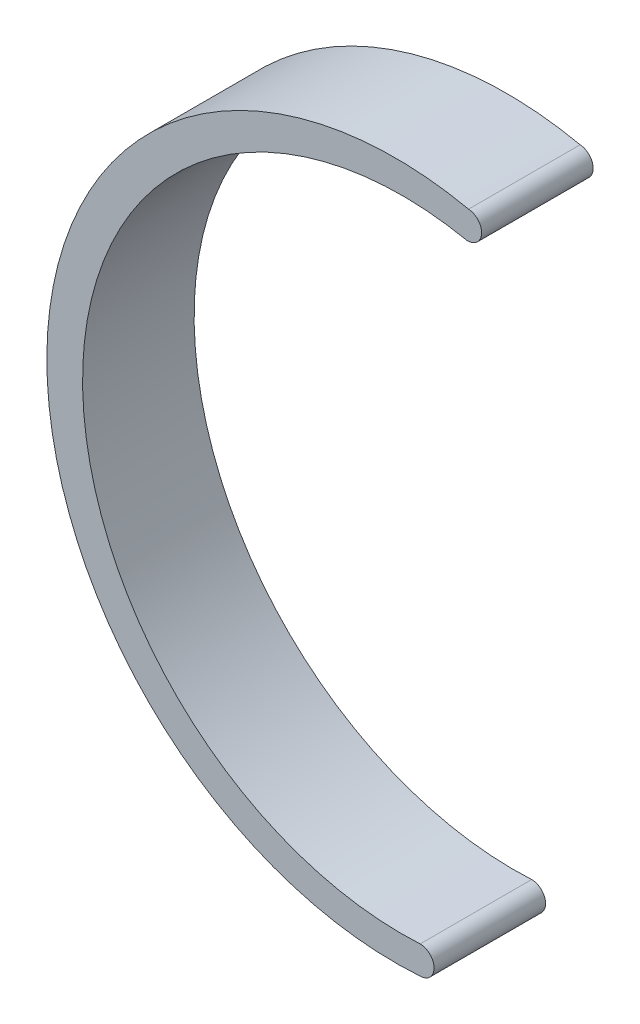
ISO-10303-21;
HEADER;
FILE_DESCRIPTION(('STEP AP214'),'2;1');
FILE_NAME('part.step','',(''),(''),'','','');
FILE_SCHEMA(('AUTOMOTIVE_DESIGN { 1 0 10303 214 1 1 1 1 }'));
ENDSEC;
DATA;
#1=APPLICATION_CONTEXT('core data for automotive mechanical design processes');
#2=APPLICATION_PROTOCOL_DEFINITION('international standard','automotive_design',2000,#1);
#3=PRODUCT_CONTEXT('',#1,'mechanical');
#4=PRODUCT('Part','Part','',(#3));
#5=PRODUCT_RELATED_PRODUCT_CATEGORY('part','',(#4));
#6=PRODUCT_DEFINITION_FORMATION('','',#4);
#7=PRODUCT_DEFINITION_CONTEXT('part definition',#1,'design');
#8=PRODUCT_DEFINITION('design','',#6,#7);
#9=PRODUCT_DEFINITION_SHAPE('','',#8);
#10=(LENGTH_UNIT() NAMED_UNIT(*) SI_UNIT(.MILLI.,.METRE.));
#11=(NAMED_UNIT(*) PLANE_ANGLE_UNIT() SI_UNIT($,.RADIAN.));
#12=(NAMED_UNIT(*) SI_UNIT($,.STERADIAN.) SOLID_ANGLE_UNIT());
#13=UNCERTAINTY_MEASURE_WITH_UNIT(LENGTH_MEASURE(1.E-05),#10,'distance_accuracy_value','');
#14=(GEOMETRIC_REPRESENTATION_CONTEXT(3) GLOBAL_UNCERTAINTY_ASSIGNED_CONTEXT((#13)) GLOBAL_UNIT_ASSIGNED_CONTEXT((#10,
#11,#12)) REPRESENTATION_CONTEXT('',''));
#15=CARTESIAN_POINT('',(0.,0.,0.));
#16=DIRECTION('',(0.,0.,1.));
#17=DIRECTION('',(1.,0.,0.));
#18=AXIS2_PLACEMENT_3D('',#15,#16,#17);
#19=CARTESIAN_POINT('',(-2.83113096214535,-91.1999760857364,30.48));
#20=DIRECTION('',(0.,0.,-1.));
#21=DIRECTION('',(-1.,0.,0.));
#22=AXIS2_PLACEMENT_3D('',#19,#20,#21);
#23=CYLINDRICAL_SURFACE('',#22,3.81);
#24=CARTESIAN_POINT('',(-2.83113096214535,-91.1999760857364,0.));
#25=DIRECTION('',(0.,0.,-1.));
#26=DIRECTION('',(-1.,0.,0.));
#27=AXIS2_PLACEMENT_3D('',#24,#25,#26);
#28=CIRCLE('',#27,3.81);
#29=CARTESIAN_POINT('',(-2.83113096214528,-87.3899760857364,0.));
#30=VERTEX_POINT('',#29);
#31=CARTESIAN_POINT('',(-2.83113096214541,-95.0099760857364,0.));
#32=VERTEX_POINT('',#31);
#33=EDGE_CURVE('E97',#30,#32,#28,.T.);
#34=ORIENTED_EDGE('',*,*,#33,.F.);
#35=DIRECTION('',(0.,0.,-1.));
#36=VECTOR('',#35,1.);
#37=CARTESIAN_POINT('',(-2.83113096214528,-87.3899760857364,30.48));
#38=LINE('',#37,#36);
#39=CARTESIAN_POINT('',(-2.83113096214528,-87.3899760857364,30.48));
#40=VERTEX_POINT('',#39);
#41=EDGE_CURVE('E11',#40,#30,#38,.T.);
#42=ORIENTED_EDGE('',*,*,#41,.F.);
#43=CARTESIAN_POINT('',(-2.83113096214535,-91.1999760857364,30.48));
#44=DIRECTION('',(0.,0.,-1.));
#45=DIRECTION('',(-1.,0.,0.));
#46=AXIS2_PLACEMENT_3D('',#43,#44,#45);
#47=CIRCLE('',#46,3.81);
#48=CARTESIAN_POINT('',(-2.83113096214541,-95.0099760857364,30.48));
#49=VERTEX_POINT('',#48);
#50=EDGE_CURVE('E89',#40,#49,#47,.T.);
#51=ORIENTED_EDGE('',*,*,#50,.T.);
#52=DIRECTION('',(0.,0.,-1.));
#53=VECTOR('',#52,1.);
#54=CARTESIAN_POINT('',(-2.83113096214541,-95.0099760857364,30.48));
#55=LINE('',#54,#53);
#56=EDGE_CURVE('E36',#49,#32,#55,.T.);
#57=ORIENTED_EDGE('',*,*,#56,.T.);
#58=EDGE_LOOP('',(#34,#42,#51,#57));
#59=FACE_BOUND('',#58,.T.);
#60=ADVANCED_FACE('F33',(#59),#23,.T.);
#61=CARTESIAN_POINT('',(-7.67164202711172,-0.119199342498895,30.48));
#62=DIRECTION('',(0.,0.,-1.));
#63=DIRECTION('',(-1.,0.,0.));
#64=AXIS2_PLACEMENT_3D('',#61,#62,#63);
#65=CYLINDRICAL_SURFACE('',#64,87.4049141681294);
#66=CARTESIAN_POINT('',(-7.67164202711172,-0.119199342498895,0.));
#67=DIRECTION('',(0.,0.,-1.));
#68=DIRECTION('',(-1.,0.,0.));
#69=AXIS2_PLACEMENT_3D('',#66,#67,#68);
#70=CIRCLE('',#69,87.4049141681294);
#71=CARTESIAN_POINT('',(9.88546017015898,85.5042039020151,0.));
#72=VERTEX_POINT('',#71);
#73=EDGE_CURVE('E103',#30,#72,#70,.T.);
#74=ORIENTED_EDGE('',*,*,#73,.T.);
#75=DIRECTION('',(0.,0.,-1.));
#76=VECTOR('',#75,1.);
#77=CARTESIAN_POINT('',(9.88546017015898,85.5042039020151,30.48));
#78=LINE('',#77,#76);
#79=CARTESIAN_POINT('',(9.88546017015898,85.5042039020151,30.48));
#80=VERTEX_POINT('',#79);
#81=EDGE_CURVE('E42',#80,#72,#78,.T.);
#82=ORIENTED_EDGE('',*,*,#81,.F.);
#83=CARTESIAN_POINT('',(-7.67164202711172,-0.119199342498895,30.48));
#84=DIRECTION('',(0.,0.,-1.));
#85=DIRECTION('',(-1.,0.,0.));
#86=AXIS2_PLACEMENT_3D('',#83,#84,#85);
#87=CIRCLE('',#86,87.4049141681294);
#88=EDGE_CURVE('E92',#40,#80,#87,.T.);
#89=ORIENTED_EDGE('',*,*,#88,.F.);
#90=ORIENTED_EDGE('',*,*,#41,.T.);
#91=EDGE_LOOP('',(#74,#82,#89,#90));
#92=FACE_BOUND('',#91,.T.);
#93=ADVANCED_FACE('F115',(#92),#65,.F.);
#94=CARTESIAN_POINT('',(10.1538613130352,89.3142039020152,30.48));
#95=DIRECTION('',(0.,0.,-1.));
#96=DIRECTION('',(-1.,0.,0.));
#97=AXIS2_PLACEMENT_3D('',#94,#95,#96);
#98=CYLINDRICAL_SURFACE('',#97,3.81944225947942);
#99=CARTESIAN_POINT('',(10.1538613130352,89.3142039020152,0.));
#100=DIRECTION('',(0.,0.,-1.));
#101=DIRECTION('',(-1.,0.,0.));
#102=AXIS2_PLACEMENT_3D('',#99,#100,#101);
#103=CIRCLE('',#102,3.81944225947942);
#104=CARTESIAN_POINT('',(10.4222624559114,93.1242039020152,0.));
#105=VERTEX_POINT('',#104);
#106=EDGE_CURVE('E84',#105,#72,#103,.T.);
#107=ORIENTED_EDGE('',*,*,#106,.F.);
#108=DIRECTION('',(0.,0.,-1.));
#109=VECTOR('',#108,1.);
#110=CARTESIAN_POINT('',(10.4222624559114,93.1242039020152,30.48));
#111=LINE('',#110,#109);
#112=CARTESIAN_POINT('',(10.4222624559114,93.1242039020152,30.48));
#113=VERTEX_POINT('',#112);
#114=EDGE_CURVE('E80',#113,#105,#111,.T.);
#115=ORIENTED_EDGE('',*,*,#114,.F.);
#116=CARTESIAN_POINT('',(10.1538613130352,89.3142039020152,30.48));
#117=DIRECTION('',(0.,0.,-1.));
#118=DIRECTION('',(-1.,0.,0.));
#119=AXIS2_PLACEMENT_3D('',#116,#117,#118);
#120=CIRCLE('',#119,3.81944225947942);
#121=EDGE_CURVE('E82',#113,#80,#120,.T.);
#122=ORIENTED_EDGE('',*,*,#121,.T.);
#123=ORIENTED_EDGE('',*,*,#81,.T.);
#124=EDGE_LOOP('',(#107,#115,#122,#123));
#125=FACE_BOUND('',#124,.T.);
#126=ADVANCED_FACE('F81',(#125),#98,.T.);
#127=CARTESIAN_POINT('',(-9.58886314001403,0.,30.48));
#128=DIRECTION('',(0.,0.,-1.));
#129=DIRECTION('',(-1.,0.,0.));
#130=AXIS2_PLACEMENT_3D('',#127,#128,#129);
#131=CYLINDRICAL_SURFACE('',#130,95.25);
#132=CARTESIAN_POINT('',(-9.58886314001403,0.,0.));
#133=DIRECTION('',(0.,0.,1.));
#134=DIRECTION('',(1.,0.,0.));
#135=AXIS2_PLACEMENT_3D('',#132,#133,#134);
#136=CIRCLE('',#135,95.25);
#137=EDGE_CURVE('E100',#105,#32,#136,.T.);
#138=ORIENTED_EDGE('',*,*,#137,.T.);
#139=ORIENTED_EDGE('',*,*,#56,.F.);
#140=CARTESIAN_POINT('',(-9.58886314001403,0.,30.48));
#141=DIRECTION('',(0.,0.,1.));
#142=DIRECTION('',(1.,0.,0.));
#143=AXIS2_PLACEMENT_3D('',#140,#141,#142);
#144=CIRCLE('',#143,95.25);
#145=EDGE_CURVE('E77',#113,#49,#144,.T.);
#146=ORIENTED_EDGE('',*,*,#145,.F.);
#147=ORIENTED_EDGE('',*,*,#114,.T.);
#148=EDGE_LOOP('',(#138,#139,#146,#147));
#149=FACE_BOUND('',#148,.T.);
#150=ADVANCED_FACE('F88',(#149),#131,.T.);
#151=CARTESIAN_POINT('',(-6.20999705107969,-45.5999880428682,30.48));
#152=DIRECTION('',(0.,0.,-1.));
#153=DIRECTION('',(-1.,0.,0.));
#154=AXIS2_PLACEMENT_3D('',#151,#152,#153);
#155=PLANE('',#154);
#156=ORIENTED_EDGE('',*,*,#50,.F.);
#157=ORIENTED_EDGE('',*,*,#88,.T.);
#158=ORIENTED_EDGE('',*,*,#121,.F.);
#159=ORIENTED_EDGE('',*,*,#145,.T.);
#160=EDGE_LOOP('',(#156,#157,#158,#159));
#161=FACE_BOUND('',#160,.T.);
#162=ADVANCED_FACE('F91',(#161),#155,.F.);
#163=CARTESIAN_POINT('',(-6.20999705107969,-45.5999880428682,0.));
#164=DIRECTION('',(0.,0.,-1.));
#165=DIRECTION('',(-1.,0.,0.));
#166=AXIS2_PLACEMENT_3D('',#163,#164,#165);
#167=PLANE('',#166);
#168=ORIENTED_EDGE('',*,*,#33,.T.);
#169=ORIENTED_EDGE('',*,*,#137,.F.);
#170=ORIENTED_EDGE('',*,*,#106,.T.);
#171=ORIENTED_EDGE('',*,*,#73,.F.);
#172=EDGE_LOOP('',(#168,#169,#170,#171));
#173=FACE_BOUND('',#172,.T.);
#174=ADVANCED_FACE('F106',(#173),#167,.T.);
#175=CLOSED_SHELL('',(#60,#93,#126,#150,#162,#174));
#176=MANIFOLD_SOLID_BREP('B2',#175);
#177=ADVANCED_BREP_SHAPE_REPRESENTATION('',(#18,#176),#14);
#178=SHAPE_DEFINITION_REPRESENTATION(#9,#177);
ENDSEC;
END-ISO-10303-21;
